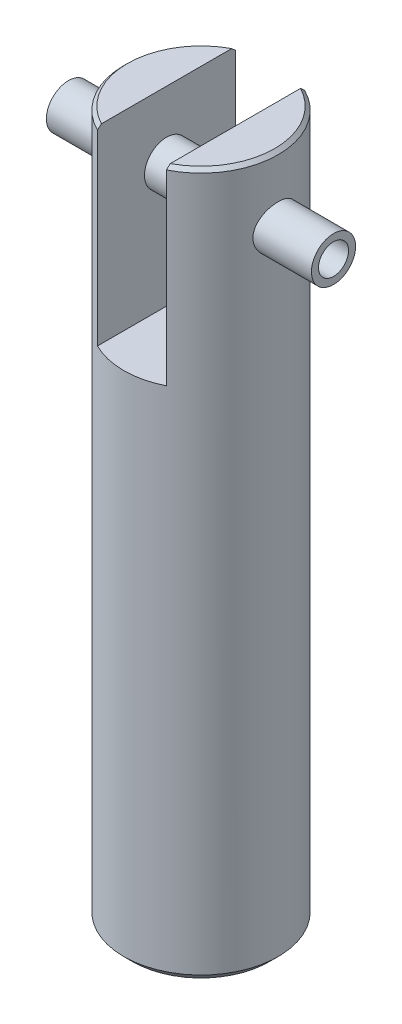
ISO-10303-21;
HEADER;
FILE_DESCRIPTION(('STEP AP214'),'2;1');
FILE_NAME('part.step','',(''),(''),'','','');
FILE_SCHEMA(('AUTOMOTIVE_DESIGN { 1 0 10303 214 1 1 1 1 }'));
ENDSEC;
DATA;
#1=APPLICATION_CONTEXT('core data for automotive mechanical design processes');
#2=APPLICATION_PROTOCOL_DEFINITION('international standard','automotive_design',2000,#1);
#3=PRODUCT_CONTEXT('',#1,'mechanical');
#4=PRODUCT('Part','Part','',(#3));
#5=PRODUCT_RELATED_PRODUCT_CATEGORY('part','',(#4));
#6=PRODUCT_DEFINITION_FORMATION('','',#4);
#7=PRODUCT_DEFINITION_CONTEXT('part definition',#1,'design');
#8=PRODUCT_DEFINITION('design','',#6,#7);
#9=PRODUCT_DEFINITION_SHAPE('','',#8);
#10=(LENGTH_UNIT() NAMED_UNIT(*) SI_UNIT(.MILLI.,.METRE.));
#11=(NAMED_UNIT(*) PLANE_ANGLE_UNIT() SI_UNIT($,.RADIAN.));
#12=(NAMED_UNIT(*) SI_UNIT($,.STERADIAN.) SOLID_ANGLE_UNIT());
#13=UNCERTAINTY_MEASURE_WITH_UNIT(LENGTH_MEASURE(1.E-05),#10,'distance_accuracy_value','');
#14=(GEOMETRIC_REPRESENTATION_CONTEXT(3) GLOBAL_UNCERTAINTY_ASSIGNED_CONTEXT((#13)) GLOBAL_UNIT_ASSIGNED_CONTEXT((#10,
#11,#12)) REPRESENTATION_CONTEXT('',''));
#15=CARTESIAN_POINT('',(0.,0.,0.));
#16=DIRECTION('',(0.,0.,1.));
#17=DIRECTION('',(1.,0.,0.));
#18=AXIS2_PLACEMENT_3D('',#15,#16,#17);
#19=CARTESIAN_POINT('',(0.,50.8,0.));
#20=DIRECTION('',(0.,1.,0.));
#21=DIRECTION('',(0.,0.,1.));
#22=AXIS2_PLACEMENT_3D('',#19,#20,#21);
#23=PLANE('',#22);
#24=DIRECTION('',(0.,0.,-1.));
#25=VECTOR('',#24,1.);
#26=CARTESIAN_POINT('',(2.4765,50.8,0.));
#27=LINE('',#26,#25);
#28=CARTESIAN_POINT('',(2.4765,50.8,4.68118623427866));
#29=VERTEX_POINT('',#28);
#30=CARTESIAN_POINT('',(2.4765,50.8,-4.68118623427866));
#31=VERTEX_POINT('',#30);
#32=EDGE_CURVE('E130',#29,#31,#27,.T.);
#33=ORIENTED_EDGE('',*,*,#32,.F.);
#34=CARTESIAN_POINT('',(0.,50.8,0.));
#35=DIRECTION('',(0.,1.,0.));
#36=DIRECTION('',(0.,0.,1.));
#37=AXIS2_PLACEMENT_3D('',#34,#35,#36);
#38=CIRCLE('',#37,5.2959);
#39=EDGE_CURVE('E173',#29,#31,#38,.T.);
#40=ORIENTED_EDGE('',*,*,#39,.T.);
#41=EDGE_LOOP('',(#33,#40));
#42=FACE_BOUND('',#41,.T.);
#43=ADVANCED_FACE('F33',(#42),#23,.T.);
#44=CARTESIAN_POINT('',(0.,50.8,0.));
#45=DIRECTION('',(0.,-1.,0.));
#46=DIRECTION('',(0.,0.,-1.));
#47=AXIS2_PLACEMENT_3D('',#44,#45,#46);
#48=CYLINDRICAL_SURFACE('',#47,5.5499);
#49=CARTESIAN_POINT('',(0.,0.634999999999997,0.));
#50=DIRECTION('',(0.,1.,0.));
#51=DIRECTION('',(0.,0.,1.));
#52=AXIS2_PLACEMENT_3D('',#49,#50,#51);
#53=CIRCLE('',#52,5.5499);
#54=CARTESIAN_POINT('',(0.,0.634999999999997,5.5499));
#55=VERTEX_POINT('',#54);
#56=EDGE_CURVE('E114',#55,#55,#53,.T.);
#57=ORIENTED_EDGE('',*,*,#56,.T.);
#58=EDGE_LOOP('',(#57));
#59=FACE_BOUND('',#58,.T.);
#60=CARTESIAN_POINT('',(-5.31801031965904,46.0375,1.5875));
#61=CARTESIAN_POINT('',(-5.31801153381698,46.124690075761,1.58749843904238));
#62=CARTESIAN_POINT('',(-5.32017803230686,46.2118959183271,1.58029244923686));
#63=CARTESIAN_POINT('',(-5.32857915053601,46.383771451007,1.55172455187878));
#64=CARTESIAN_POINT('',(-5.33481541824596,46.4684400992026,1.53035690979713));
#65=CARTESIAN_POINT('',(-5.35059325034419,46.6327291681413,1.47423984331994));
#66=CARTESIAN_POINT('',(-5.36012968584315,46.712357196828,1.43951117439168));
#67=CARTESIAN_POINT('',(-5.38142657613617,46.8646733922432,1.357724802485));
#68=CARTESIAN_POINT('',(-5.39318729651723,46.9373607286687,1.31066562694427));
#69=CARTESIAN_POINT('',(-5.41798697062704,47.0758233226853,1.20410525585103));
#70=CARTESIAN_POINT('',(-5.43105123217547,47.141369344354,1.14431201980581));
#71=CARTESIAN_POINT('',(-5.45676883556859,47.2616535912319,1.01460766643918));
#72=CARTESIAN_POINT('',(-5.4694221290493,47.31639054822,0.944695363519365));
#73=CARTESIAN_POINT('',(-5.49317740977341,47.414481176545,0.795124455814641));
#74=CARTESIAN_POINT('',(-5.50424608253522,47.457603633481,0.715308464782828));
#75=CARTESIAN_POINT('',(-5.52329253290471,47.5297275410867,0.549188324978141));
#76=CARTESIAN_POINT('',(-5.53127091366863,47.5587317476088,0.462885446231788));
#77=CARTESIAN_POINT('',(-5.5430588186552,47.6010444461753,0.28863733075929));
#78=CARTESIAN_POINT('',(-5.54697193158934,47.6147436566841,0.200794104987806));
#79=CARTESIAN_POINT('',(-5.55055207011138,47.6272902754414,0.0239748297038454));
#80=CARTESIAN_POINT('',(-5.55021990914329,47.6261405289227,-0.0650009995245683));
#81=CARTESIAN_POINT('',(-5.54542130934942,47.6092897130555,-0.238828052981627));
#82=CARTESIAN_POINT('',(-5.54107496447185,47.5940113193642,-0.32372408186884));
#83=CARTESIAN_POINT('',(-5.528880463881,47.5500240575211,-0.489692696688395));
#84=CARTESIAN_POINT('',(-5.52103209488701,47.52131437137,-0.570765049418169));
#85=CARTESIAN_POINT('',(-5.5025441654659,47.4509772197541,-0.727821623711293));
#86=CARTESIAN_POINT('',(-5.49187498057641,47.4092117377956,-0.803740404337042));
#87=CARTESIAN_POINT('',(-5.46888495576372,47.3140562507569,-0.947630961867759));
#88=CARTESIAN_POINT('',(-5.45656375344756,47.2606636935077,-1.01560098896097));
#89=CARTESIAN_POINT('',(-5.43108415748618,47.1415547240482,-1.14418800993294));
#90=CARTESIAN_POINT('',(-5.41791156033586,47.0754709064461,-1.20446229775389));
#91=CARTESIAN_POINT('',(-5.39259795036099,46.9340008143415,-1.31316439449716));
#92=CARTESIAN_POINT('',(-5.38045702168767,46.8586137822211,-1.36159123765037));
#93=CARTESIAN_POINT('',(-5.35851793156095,46.6998444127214,-1.44553848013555));
#94=CARTESIAN_POINT('',(-5.34873933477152,46.6164028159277,-1.48095228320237));
#95=CARTESIAN_POINT('',(-5.33286814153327,46.4443979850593,-1.53713018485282));
#96=CARTESIAN_POINT('',(-5.3267744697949,46.3558362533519,-1.55789855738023));
#97=CARTESIAN_POINT('',(-5.31919614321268,46.1793426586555,-1.58357719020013));
#98=CARTESIAN_POINT('',(-5.31756136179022,46.0914923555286,-1.58900421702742));
#99=CARTESIAN_POINT('',(-5.3186726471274,45.916136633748,-1.58528092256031));
#100=CARTESIAN_POINT('',(-5.32141816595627,45.8286311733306,-1.57613242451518));
#101=CARTESIAN_POINT('',(-5.33083433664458,45.6585323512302,-1.54397609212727));
#102=CARTESIAN_POINT('',(-5.33741340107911,45.5758723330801,-1.52129135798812));
#103=CARTESIAN_POINT('',(-5.35366280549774,45.4155339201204,-1.46307617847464));
#104=CARTESIAN_POINT('',(-5.36333359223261,45.3378562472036,-1.42754387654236));
#105=CARTESIAN_POINT('',(-5.38497521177,45.1875596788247,-1.34363252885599));
#106=CARTESIAN_POINT('',(-5.39699712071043,45.1151139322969,-1.29495684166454));
#107=CARTESIAN_POINT('',(-5.4218722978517,44.979229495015,-1.18649929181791));
#108=CARTESIAN_POINT('',(-5.43472574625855,44.9157927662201,-1.12671501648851));
#109=CARTESIAN_POINT('',(-5.46034251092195,44.7975168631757,-0.995324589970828));
#110=CARTESIAN_POINT('',(-5.47308803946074,44.743041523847,-0.923386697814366));
#111=CARTESIAN_POINT('',(-5.49661105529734,44.6469327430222,-0.771093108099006));
#112=CARTESIAN_POINT('',(-5.50738864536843,44.60529863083,-0.690737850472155));
#113=CARTESIAN_POINT('',(-5.52569290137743,44.5364517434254,-0.52444614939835));
#114=CARTESIAN_POINT('',(-5.53324408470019,44.5091298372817,-0.438557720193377));
#115=CARTESIAN_POINT('',(-5.54435299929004,44.4693847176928,-0.26315653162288));
#116=CARTESIAN_POINT('',(-5.54791176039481,44.4569576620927,-0.173644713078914));
#117=CARTESIAN_POINT('',(-5.55057818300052,44.4476253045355,0.00308479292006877));
#118=CARTESIAN_POINT('',(-5.54983786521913,44.4501899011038,0.0902725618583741));
#119=CARTESIAN_POINT('',(-5.54434135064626,44.4695165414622,0.262923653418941));
#120=CARTESIAN_POINT('',(-5.5395853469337,44.4862779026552,0.348387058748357));
#121=CARTESIAN_POINT('',(-5.52662972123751,44.5332056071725,0.514424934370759));
#122=CARTESIAN_POINT('',(-5.51846140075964,44.5632502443,0.595036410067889));
#123=CARTESIAN_POINT('',(-5.49952923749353,44.6357833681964,0.750118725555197));
#124=CARTESIAN_POINT('',(-5.48876499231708,44.6782737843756,0.824588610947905));
#125=CARTESIAN_POINT('',(-5.46538170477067,44.7759636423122,0.967682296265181));
#126=CARTESIAN_POINT('',(-5.4527169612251,44.8315039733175,1.03606585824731));
#127=CARTESIAN_POINT('',(-5.42712211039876,44.9530892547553,1.16272058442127));
#128=CARTESIAN_POINT('',(-5.41419193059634,45.0191371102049,1.22098894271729));
#129=CARTESIAN_POINT('',(-5.38913280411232,45.1619533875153,1.32729226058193));
#130=CARTESIAN_POINT('',(-5.37703394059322,45.2389584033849,1.37501717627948));
#131=CARTESIAN_POINT('',(-5.35546231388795,45.4002349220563,1.45678158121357));
#132=CARTESIAN_POINT('',(-5.34598808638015,45.4845023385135,1.49082870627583));
#133=CARTESIAN_POINT('',(-5.33184181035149,45.6464401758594,1.54059382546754));
#134=CARTESIAN_POINT('',(-5.32670086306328,45.7235125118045,1.55813839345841));
#135=CARTESIAN_POINT('',(-5.31978483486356,45.8795524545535,1.58159126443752));
#136=CARTESIAN_POINT('',(-5.31800921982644,45.9585197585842,1.58750141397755));
#137=CARTESIAN_POINT('',(-5.31801031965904,46.0375,1.5875));
#138=B_SPLINE_CURVE_WITH_KNOTS('',3,(#60,#61,#62,#63,#64,#65,#66,#67,#68,#69,#70,#71,#72,#73,
#74,#75,#76,#77,#78,#79,#80,#81,#82,#83,#84,#85,#86,#87,#88,#89,#90,#91,#92,#93,#94,#95,#96,#97,
#98,#99,#100,#101,#102,#103,#104,#105,#106,#107,#108,#109,#110,#111,#112,#113,#114,#115,#116,
#117,#118,#119,#120,#121,#122,#123,#124,#125,#126,#127,#128,#129,#130,#131,#132,#133,#134,#135,
#136,#137),.UNSPECIFIED.,.T.,.F.,(4,2,2,2,2,2,2,2,2,2,2,2,2,2,2,2,2,2,2,2,2,2,2,2,2,2,2,2,2,2,2,
2,2,2,2,2,2,2,4),(0.,0.261279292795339,0.522664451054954,0.783645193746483,1.04465711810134,
1.31246475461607,1.58030379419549,1.85313558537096,2.12591409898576,2.39155735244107,
2.65714970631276,2.91504496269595,3.17295592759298,3.43369121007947,3.69448378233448,
3.96444898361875,4.23443618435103,4.50658812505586,4.77866061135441,5.0414525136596,
5.30421154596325,5.56093639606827,5.81769835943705,6.08082560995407,6.34401007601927,
6.61610579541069,6.88818730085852,7.15816281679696,7.42806867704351,7.68848982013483,
7.94889844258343,8.20696901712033,8.46507962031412,8.73087921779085,8.99675242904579,
9.26963013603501,9.54235529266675,9.77907004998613,10.0157472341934),.UNSPECIFIED.);
#139=CARTESIAN_POINT('',(-5.31801031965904,46.0375,1.5875));
#140=VERTEX_POINT('',#139);
#141=EDGE_CURVE('E217',#140,#140,#138,.T.);
#142=ORIENTED_EDGE('',*,*,#141,.F.);
#143=EDGE_LOOP('',(#142));
#144=FACE_BOUND('',#143,.T.);
#145=CARTESIAN_POINT('',(5.31801031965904,46.0375,1.5875));
#146=CARTESIAN_POINT('',(5.31801153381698,45.950309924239,1.58749843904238));
#147=CARTESIAN_POINT('',(5.32017803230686,45.8631040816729,1.58029244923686));
#148=CARTESIAN_POINT('',(5.32857915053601,45.691228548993,1.55172455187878));
#149=CARTESIAN_POINT('',(5.33481541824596,45.6065599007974,1.53035690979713));
#150=CARTESIAN_POINT('',(5.35059325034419,45.4422708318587,1.47423984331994));
#151=CARTESIAN_POINT('',(5.36012968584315,45.362642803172,1.43951117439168));
#152=CARTESIAN_POINT('',(5.38142657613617,45.2103266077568,1.357724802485));
#153=CARTESIAN_POINT('',(5.39318729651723,45.1376392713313,1.31066562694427));
#154=CARTESIAN_POINT('',(5.41798697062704,44.9991766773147,1.20410525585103));
#155=CARTESIAN_POINT('',(5.43105123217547,44.933630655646,1.14431201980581));
#156=CARTESIAN_POINT('',(5.45676883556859,44.8133464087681,1.01460766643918));
#157=CARTESIAN_POINT('',(5.4694221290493,44.75860945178,0.944695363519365));
#158=CARTESIAN_POINT('',(5.49317740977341,44.6605188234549,0.79512445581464));
#159=CARTESIAN_POINT('',(5.50424608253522,44.617396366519,0.715308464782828));
#160=CARTESIAN_POINT('',(5.52329253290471,44.5452724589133,0.549188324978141));
#161=CARTESIAN_POINT('',(5.53127091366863,44.5162682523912,0.462885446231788));
#162=CARTESIAN_POINT('',(5.5430588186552,44.4739555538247,0.28863733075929));
#163=CARTESIAN_POINT('',(5.54697193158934,44.4602563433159,0.200794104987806));
#164=CARTESIAN_POINT('',(5.55055207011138,44.4477097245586,0.0239748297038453));
#165=CARTESIAN_POINT('',(5.55021990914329,44.4488594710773,-0.0650009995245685));
#166=CARTESIAN_POINT('',(5.54542130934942,44.4657102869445,-0.238828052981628));
#167=CARTESIAN_POINT('',(5.54107496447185,44.4809886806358,-0.323724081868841));
#168=CARTESIAN_POINT('',(5.528880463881,44.5249759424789,-0.489692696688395));
#169=CARTESIAN_POINT('',(5.52103209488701,44.55368562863,-0.570765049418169));
#170=CARTESIAN_POINT('',(5.5025441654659,44.6240227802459,-0.727821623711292));
#171=CARTESIAN_POINT('',(5.49187498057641,44.6657882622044,-0.803740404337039));
#172=CARTESIAN_POINT('',(5.46888495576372,44.7609437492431,-0.947630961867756));
#173=CARTESIAN_POINT('',(5.45656375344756,44.8143363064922,-1.01560098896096));
#174=CARTESIAN_POINT('',(5.43108415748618,44.9334452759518,-1.14418800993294));
#175=CARTESIAN_POINT('',(5.41791156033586,44.9995290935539,-1.20446229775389));
#176=CARTESIAN_POINT('',(5.39259795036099,45.1409991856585,-1.31316439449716));
#177=CARTESIAN_POINT('',(5.38045702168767,45.2163862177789,-1.36159123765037));
#178=CARTESIAN_POINT('',(5.35851793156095,45.3751555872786,-1.44553848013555));
#179=CARTESIAN_POINT('',(5.34873933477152,45.4585971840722,-1.48095228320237));
#180=CARTESIAN_POINT('',(5.33286814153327,45.6306020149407,-1.53713018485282));
#181=CARTESIAN_POINT('',(5.3267744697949,45.719163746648,-1.55789855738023));
#182=CARTESIAN_POINT('',(5.31919614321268,45.8956573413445,-1.58357719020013));
#183=CARTESIAN_POINT('',(5.31756136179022,45.9835076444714,-1.58900421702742));
#184=CARTESIAN_POINT('',(5.3186726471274,46.158863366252,-1.58528092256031));
#185=CARTESIAN_POINT('',(5.32141816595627,46.2463688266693,-1.57613242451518));
#186=CARTESIAN_POINT('',(5.33083433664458,46.4164676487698,-1.54397609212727));
#187=CARTESIAN_POINT('',(5.33741340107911,46.4991276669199,-1.52129135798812));
#188=CARTESIAN_POINT('',(5.35366280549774,46.6594660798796,-1.46307617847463));
#189=CARTESIAN_POINT('',(5.36333359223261,46.7371437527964,-1.42754387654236));
#190=CARTESIAN_POINT('',(5.38497521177,46.8874403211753,-1.34363252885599));
#191=CARTESIAN_POINT('',(5.39699712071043,46.9598860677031,-1.29495684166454));
#192=CARTESIAN_POINT('',(5.4218722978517,47.095770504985,-1.18649929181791));
#193=CARTESIAN_POINT('',(5.43472574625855,47.1592072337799,-1.12671501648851));
#194=CARTESIAN_POINT('',(5.46034251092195,47.2774831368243,-0.995324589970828));
#195=CARTESIAN_POINT('',(5.47308803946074,47.331958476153,-0.923386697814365));
#196=CARTESIAN_POINT('',(5.49661105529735,47.4280672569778,-0.771093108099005));
#197=CARTESIAN_POINT('',(5.50738864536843,47.46970136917,-0.690737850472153));
#198=CARTESIAN_POINT('',(5.52569290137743,47.5385482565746,-0.524446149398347));
#199=CARTESIAN_POINT('',(5.53324408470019,47.5658701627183,-0.438557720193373));
#200=CARTESIAN_POINT('',(5.54435299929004,47.6056152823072,-0.263156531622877));
#201=CARTESIAN_POINT('',(5.54791176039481,47.6180423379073,-0.173644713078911));
#202=CARTESIAN_POINT('',(5.55057818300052,47.6273746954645,0.00308479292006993));
#203=CARTESIAN_POINT('',(5.54983786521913,47.6248100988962,0.0902725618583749));
#204=CARTESIAN_POINT('',(5.54434135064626,47.6054834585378,0.262923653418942));
#205=CARTESIAN_POINT('',(5.5395853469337,47.5887220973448,0.348387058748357));
#206=CARTESIAN_POINT('',(5.52662972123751,47.5417943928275,0.514424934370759));
#207=CARTESIAN_POINT('',(5.51846140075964,47.5117497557,0.595036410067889));
#208=CARTESIAN_POINT('',(5.49952923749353,47.4392166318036,0.750118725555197));
#209=CARTESIAN_POINT('',(5.48876499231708,47.3967262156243,0.824588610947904));
#210=CARTESIAN_POINT('',(5.46538170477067,47.2990363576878,0.967682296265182));
#211=CARTESIAN_POINT('',(5.4527169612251,47.2434960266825,1.03606585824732));
#212=CARTESIAN_POINT('',(5.42712211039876,47.1219107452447,1.16272058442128));
#213=CARTESIAN_POINT('',(5.41419193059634,47.0558628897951,1.22098894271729));
#214=CARTESIAN_POINT('',(5.38913280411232,46.9130466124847,1.32729226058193));
#215=CARTESIAN_POINT('',(5.37703394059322,46.8360415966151,1.37501717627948));
#216=CARTESIAN_POINT('',(5.35546231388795,46.6747650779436,1.45678158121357));
#217=CARTESIAN_POINT('',(5.34598808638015,46.5904976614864,1.49082870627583));
#218=CARTESIAN_POINT('',(5.33184181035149,46.4285598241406,1.54059382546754));
#219=CARTESIAN_POINT('',(5.32670086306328,46.3514874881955,1.55813839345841));
#220=CARTESIAN_POINT('',(5.31978483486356,46.1954475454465,1.58159126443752));
#221=CARTESIAN_POINT('',(5.31800921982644,46.1164802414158,1.58750141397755));
#222=CARTESIAN_POINT('',(5.31801031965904,46.0375,1.5875));
#223=B_SPLINE_CURVE_WITH_KNOTS('',3,(#145,#146,#147,#148,#149,#150,#151,#152,#153,#154,#155,
#156,#157,#158,#159,#160,#161,#162,#163,#164,#165,#166,#167,#168,#169,#170,#171,#172,#173,#174,
#175,#176,#177,#178,#179,#180,#181,#182,#183,#184,#185,#186,#187,#188,#189,#190,#191,#192,#193,
#194,#195,#196,#197,#198,#199,#200,#201,#202,#203,#204,#205,#206,#207,#208,#209,#210,#211,#212,
#213,#214,#215,#216,#217,#218,#219,#220,#221,#222),.UNSPECIFIED.,.T.,.F.,(4,2,2,2,2,2,2,2,2,2,2,
2,2,2,2,2,2,2,2,2,2,2,2,2,2,2,2,2,2,2,2,2,2,2,2,2,2,2,4),(0.,0.261279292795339,
0.522664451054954,0.783645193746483,1.04465711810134,1.31246475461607,1.58030379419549,
1.85313558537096,2.12591409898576,2.39155735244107,2.65714970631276,2.91504496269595,
3.17295592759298,3.43369121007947,3.69448378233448,3.96444898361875,4.23443618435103,
4.50658812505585,4.77866061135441,5.0414525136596,5.30421154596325,5.56093639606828,
5.81769835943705,6.08082560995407,6.34401007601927,6.61610579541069,6.88818730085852,
7.15816281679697,7.42806867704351,7.68848982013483,7.94889844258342,8.20696901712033,
8.46507962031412,8.73087921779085,8.99675242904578,9.26963013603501,9.54235529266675,
9.77907004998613,10.0157472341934),.UNSPECIFIED.);
#224=CARTESIAN_POINT('',(5.31801031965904,46.0375,1.5875));
#225=VERTEX_POINT('',#224);
#226=EDGE_CURVE('E121',#225,#225,#223,.T.);
#227=ORIENTED_EDGE('',*,*,#226,.F.);
#228=EDGE_LOOP('',(#227));
#229=FACE_BOUND('',#228,.T.);
#230=DIRECTION('',(0.,-1.,0.));
#231=VECTOR('',#230,1.);
#232=CARTESIAN_POINT('',(-2.4765,50.8,4.96672304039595));
#233=LINE('',#232,#231);
#234=CARTESIAN_POINT('',(-2.4765,37.1094,4.96672304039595));
#235=VERTEX_POINT('',#234);
#236=CARTESIAN_POINT('',(-2.4765,50.546,4.96672304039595));
#237=VERTEX_POINT('',#236);
#238=EDGE_CURVE('E103',#235,#237,#233,.F.);
#239=ORIENTED_EDGE('',*,*,#238,.T.);
#240=CARTESIAN_POINT('',(0.,50.546,0.));
#241=DIRECTION('',(0.,1.,0.));
#242=DIRECTION('',(0.,0.,1.));
#243=AXIS2_PLACEMENT_3D('',#240,#241,#242);
#244=CIRCLE('',#243,5.5499);
#245=CARTESIAN_POINT('',(-2.4765,50.546,-4.96672304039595));
#246=VERTEX_POINT('',#245);
#247=EDGE_CURVE('E98',#237,#246,#244,.F.);
#248=ORIENTED_EDGE('',*,*,#247,.T.);
#249=DIRECTION('',(0.,-1.,0.));
#250=VECTOR('',#249,1.);
#251=CARTESIAN_POINT('',(-2.4765,50.8,-4.96672304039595));
#252=LINE('',#251,#250);
#253=CARTESIAN_POINT('',(-2.4765,37.1094,-4.96672304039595));
#254=VERTEX_POINT('',#253);
#255=EDGE_CURVE('E91',#246,#254,#252,.T.);
#256=ORIENTED_EDGE('',*,*,#255,.T.);
#257=CARTESIAN_POINT('',(0.,37.1094,0.));
#258=DIRECTION('',(0.,1.,0.));
#259=DIRECTION('',(0.,0.,1.));
#260=AXIS2_PLACEMENT_3D('',#257,#258,#259);
#261=CIRCLE('',#260,5.5499);
#262=CARTESIAN_POINT('',(2.4765,37.1094,-4.96672304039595));
#263=VERTEX_POINT('',#262);
#264=EDGE_CURVE('E96',#263,#254,#261,.T.);
#265=ORIENTED_EDGE('',*,*,#264,.F.);
#266=DIRECTION('',(0.,-1.,0.));
#267=VECTOR('',#266,1.);
#268=CARTESIAN_POINT('',(2.4765,50.8,-4.96672304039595));
#269=LINE('',#268,#267);
#270=CARTESIAN_POINT('',(2.4765,50.546,-4.96672304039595));
#271=VERTEX_POINT('',#270);
#272=EDGE_CURVE('E102',#263,#271,#269,.F.);
#273=ORIENTED_EDGE('',*,*,#272,.T.);
#274=CARTESIAN_POINT('',(0.,50.546,0.));
#275=DIRECTION('',(0.,1.,0.));
#276=DIRECTION('',(0.,0.,1.));
#277=AXIS2_PLACEMENT_3D('',#274,#275,#276);
#278=CIRCLE('',#277,5.5499);
#279=CARTESIAN_POINT('',(2.4765,50.546,4.96672304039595));
#280=VERTEX_POINT('',#279);
#281=EDGE_CURVE('E175',#271,#280,#278,.F.);
#282=ORIENTED_EDGE('',*,*,#281,.T.);
#283=DIRECTION('',(0.,-1.,0.));
#284=VECTOR('',#283,1.);
#285=CARTESIAN_POINT('',(2.4765,50.8,4.96672304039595));
#286=LINE('',#285,#284);
#287=CARTESIAN_POINT('',(2.4765,37.1094,4.96672304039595));
#288=VERTEX_POINT('',#287);
#289=EDGE_CURVE('E126',#280,#288,#286,.T.);
#290=ORIENTED_EDGE('',*,*,#289,.T.);
#291=EDGE_CURVE('E115',#235,#288,#261,.T.);
#292=ORIENTED_EDGE('',*,*,#291,.F.);
#293=EDGE_LOOP('',(#239,#248,#256,#265,#273,#282,#290,#292));
#294=FACE_BOUND('',#293,.T.);
#295=ADVANCED_FACE('F94',(#59,#144,#229,#294),#48,.T.);
#296=DIRECTION('',(0.,0.,1.));
#297=VECTOR('',#296,1.);
#298=CARTESIAN_POINT('',(-2.4765,50.8,0.));
#299=LINE('',#298,#297);
#300=CARTESIAN_POINT('',(-2.4765,50.8,-4.68118623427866));
#301=VERTEX_POINT('',#300);
#302=CARTESIAN_POINT('',(-2.4765,50.8,4.68118623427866));
#303=VERTEX_POINT('',#302);
#304=EDGE_CURVE('E128',#301,#303,#299,.T.);
#305=ORIENTED_EDGE('',*,*,#304,.F.);
#306=CARTESIAN_POINT('',(0.,50.8,0.));
#307=DIRECTION('',(0.,1.,0.));
#308=DIRECTION('',(0.,0.,1.));
#309=AXIS2_PLACEMENT_3D('',#306,#307,#308);
#310=CIRCLE('',#309,5.2959);
#311=EDGE_CURVE('E137',#301,#303,#310,.T.);
#312=ORIENTED_EDGE('',*,*,#311,.T.);
#313=EDGE_LOOP('',(#305,#312));
#314=FACE_BOUND('',#313,.T.);
#315=ADVANCED_FACE('F166',(#314),#23,.T.);
#316=CARTESIAN_POINT('',(0.,0.,0.));
#317=DIRECTION('',(0.,1.,0.));
#318=DIRECTION('',(0.,0.,1.));
#319=AXIS2_PLACEMENT_3D('',#316,#317,#318);
#320=PLANE('',#319);
#321=CARTESIAN_POINT('',(0.,0.,0.));
#322=DIRECTION('',(0.,1.,0.));
#323=DIRECTION('',(0.,0.,1.));
#324=AXIS2_PLACEMENT_3D('',#321,#322,#323);
#325=CIRCLE('',#324,4.9149);
#326=CARTESIAN_POINT('',(0.,0.,4.9149));
#327=VERTEX_POINT('',#326);
#328=EDGE_CURVE('E134',#327,#327,#325,.F.);
#329=ORIENTED_EDGE('',*,*,#328,.T.);
#330=EDGE_LOOP('',(#329));
#331=FACE_BOUND('',#330,.T.);
#332=ADVANCED_FACE('F181',(#331),#320,.F.);
#333=CARTESIAN_POINT('',(0.,37.1094,0.));
#334=DIRECTION('',(0.,1.,0.));
#335=DIRECTION('',(0.,0.,1.));
#336=AXIS2_PLACEMENT_3D('',#333,#334,#335);
#337=PLANE('',#336);
#338=ORIENTED_EDGE('',*,*,#264,.T.);
#339=DIRECTION('',(0.,0.,1.));
#340=VECTOR('',#339,1.);
#341=CARTESIAN_POINT('',(-2.4765,37.1094,-9.525));
#342=LINE('',#341,#340);
#343=EDGE_CURVE('E110',#254,#235,#342,.T.);
#344=ORIENTED_EDGE('',*,*,#343,.T.);
#345=ORIENTED_EDGE('',*,*,#291,.T.);
#346=DIRECTION('',(0.,0.,-1.));
#347=VECTOR('',#346,1.);
#348=CARTESIAN_POINT('',(2.4765,37.1094,-9.525));
#349=LINE('',#348,#347);
#350=EDGE_CURVE('E113',#288,#263,#349,.T.);
#351=ORIENTED_EDGE('',*,*,#350,.T.);
#352=EDGE_LOOP('',(#338,#344,#345,#351));
#353=FACE_BOUND('',#352,.T.);
#354=ADVANCED_FACE('F108',(#353),#337,.T.);
#355=CARTESIAN_POINT('',(2.4765,37.1094,-9.525));
#356=DIRECTION('',(1.,0.,0.));
#357=DIRECTION('',(0.,0.,-1.));
#358=AXIS2_PLACEMENT_3D('',#355,#356,#357);
#359=PLANE('',#358);
#360=CARTESIAN_POINT('',(2.4765,46.0375,0.));
#361=DIRECTION('',(1.,0.,0.));
#362=DIRECTION('',(0.,0.,-1.));
#363=AXIS2_PLACEMENT_3D('',#360,#361,#362);
#364=CIRCLE('',#363,1.5875);
#365=CARTESIAN_POINT('',(2.4765,46.0375,1.5875));
#366=VERTEX_POINT('',#365);
#367=EDGE_CURVE('E222',#366,#366,#364,.F.);
#368=ORIENTED_EDGE('',*,*,#367,.F.);
#369=EDGE_LOOP('',(#368));
#370=FACE_BOUND('',#369,.T.);
#371=ORIENTED_EDGE('',*,*,#32,.T.);
#372=CARTESIAN_POINT('',(2.4765,50.8,-4.68118623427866));
#373=CARTESIAN_POINT('',(2.4765,50.757812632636,-4.72890555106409));
#374=CARTESIAN_POINT('',(2.4765,50.7155522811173,-4.77655994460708));
#375=CARTESIAN_POINT('',(2.4765,50.6308856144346,-4.87173887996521));
#376=CARTESIAN_POINT('',(2.4765,50.5884792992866,-4.91926342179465));
#377=CARTESIAN_POINT('',(2.4765,50.546,-4.96672304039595));
#378=B_SPLINE_CURVE_WITH_KNOTS('',3,(#372,#373,#374,#375,#376,#377),.UNSPECIFIED.,.F.,.F.,(4,2,
4),(0.,0.191080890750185,0.382161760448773),.UNSPECIFIED.);
#379=EDGE_CURVE('E11',#31,#271,#378,.T.);
#380=ORIENTED_EDGE('',*,*,#379,.T.);
#381=ORIENTED_EDGE('',*,*,#272,.F.);
#382=ORIENTED_EDGE('',*,*,#350,.F.);
#383=ORIENTED_EDGE('',*,*,#289,.F.);
#384=CARTESIAN_POINT('',(2.4765,50.546,4.96672304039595));
#385=CARTESIAN_POINT('',(2.4765,50.5884792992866,4.91926342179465));
#386=CARTESIAN_POINT('',(2.4765,50.6308856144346,4.87173887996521));
#387=CARTESIAN_POINT('',(2.4765,50.7155522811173,4.77655994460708));
#388=CARTESIAN_POINT('',(2.4765,50.757812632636,4.72890555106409));
#389=CARTESIAN_POINT('',(2.4765,50.8,4.68118623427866));
#390=B_SPLINE_CURVE_WITH_KNOTS('',3,(#384,#385,#386,#387,#388,#389),.UNSPECIFIED.,.F.,.F.,(4,2,
4),(0.,0.191080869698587,0.382161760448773),.UNSPECIFIED.);
#391=EDGE_CURVE('E46',#280,#29,#390,.T.);
#392=ORIENTED_EDGE('',*,*,#391,.T.);
#393=EDGE_LOOP('',(#371,#380,#381,#382,#383,#392));
#394=FACE_BOUND('',#393,.T.);
#395=ADVANCED_FACE('F158',(#370,#394),#359,.F.);
#396=CARTESIAN_POINT('',(-2.4765,37.1094,-9.525));
#397=DIRECTION('',(-1.,0.,0.));
#398=DIRECTION('',(0.,0.,1.));
#399=AXIS2_PLACEMENT_3D('',#396,#397,#398);
#400=PLANE('',#399);
#401=CARTESIAN_POINT('',(-2.4765,46.0375,0.));
#402=DIRECTION('',(-1.,0.,0.));
#403=DIRECTION('',(0.,0.,1.));
#404=AXIS2_PLACEMENT_3D('',#401,#402,#403);
#405=CIRCLE('',#404,1.5875);
#406=CARTESIAN_POINT('',(-2.4765,46.0375,1.5875));
#407=VERTEX_POINT('',#406);
#408=EDGE_CURVE('E255',#407,#407,#405,.F.);
#409=ORIENTED_EDGE('',*,*,#408,.F.);
#410=EDGE_LOOP('',(#409));
#411=FACE_BOUND('',#410,.T.);
#412=ORIENTED_EDGE('',*,*,#304,.T.);
#413=CARTESIAN_POINT('',(-2.4765,50.8,4.68118623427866));
#414=CARTESIAN_POINT('',(-2.4765,50.757812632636,4.72890555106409));
#415=CARTESIAN_POINT('',(-2.4765,50.7155522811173,4.77655994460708));
#416=CARTESIAN_POINT('',(-2.4765,50.6308856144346,4.87173887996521));
#417=CARTESIAN_POINT('',(-2.4765,50.5884792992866,4.91926342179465));
#418=CARTESIAN_POINT('',(-2.4765,50.546,4.96672304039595));
#419=B_SPLINE_CURVE_WITH_KNOTS('',3,(#413,#414,#415,#416,#417,#418),.UNSPECIFIED.,.F.,.F.,(4,2,
4),(0.,0.191080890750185,0.382161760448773),.UNSPECIFIED.);
#420=EDGE_CURVE('E146',#303,#237,#419,.T.);
#421=ORIENTED_EDGE('',*,*,#420,.T.);
#422=ORIENTED_EDGE('',*,*,#238,.F.);
#423=ORIENTED_EDGE('',*,*,#343,.F.);
#424=ORIENTED_EDGE('',*,*,#255,.F.);
#425=CARTESIAN_POINT('',(-2.4765,50.546,-4.96672304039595));
#426=CARTESIAN_POINT('',(-2.4765,50.5884792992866,-4.91926342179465));
#427=CARTESIAN_POINT('',(-2.4765,50.6308856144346,-4.87173887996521));
#428=CARTESIAN_POINT('',(-2.4765,50.7155522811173,-4.77655994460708));
#429=CARTESIAN_POINT('',(-2.4765,50.757812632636,-4.72890555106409));
#430=CARTESIAN_POINT('',(-2.4765,50.8,-4.68118623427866));
#431=B_SPLINE_CURVE_WITH_KNOTS('',3,(#425,#426,#427,#428,#429,#430),.UNSPECIFIED.,.F.,.F.,(4,2,
4),(0.,0.191080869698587,0.382161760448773),.UNSPECIFIED.);
#432=EDGE_CURVE('E140',#246,#301,#431,.T.);
#433=ORIENTED_EDGE('',*,*,#432,.T.);
#434=EDGE_LOOP('',(#412,#421,#422,#423,#424,#433));
#435=FACE_BOUND('',#434,.T.);
#436=ADVANCED_FACE('F118',(#411,#435),#400,.F.);
#437=CARTESIAN_POINT('',(0.,0.634999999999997,0.));
#438=DIRECTION('',(0.,1.,0.));
#439=DIRECTION('',(0.,0.,1.));
#440=AXIS2_PLACEMENT_3D('',#437,#438,#439);
#441=CONICAL_SURFACE('',#440,5.5499,0.785398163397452);
#442=ORIENTED_EDGE('',*,*,#328,.F.);
#443=EDGE_LOOP('',(#442));
#444=FACE_BOUND('',#443,.T.);
#445=ORIENTED_EDGE('',*,*,#56,.F.);
#446=EDGE_LOOP('',(#445));
#447=FACE_BOUND('',#446,.T.);
#448=ADVANCED_FACE('F157',(#444,#447),#441,.T.);
#449=CARTESIAN_POINT('',(0.,50.8,0.));
#450=DIRECTION('',(0.,-1.,0.));
#451=DIRECTION('',(0.,0.,-1.));
#452=AXIS2_PLACEMENT_3D('',#449,#450,#451);
#453=CONICAL_SURFACE('',#452,5.2959,0.785398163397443);
#454=ORIENTED_EDGE('',*,*,#432,.F.);
#455=ORIENTED_EDGE('',*,*,#247,.F.);
#456=ORIENTED_EDGE('',*,*,#420,.F.);
#457=ORIENTED_EDGE('',*,*,#311,.F.);
#458=EDGE_LOOP('',(#454,#455,#456,#457));
#459=FACE_BOUND('',#458,.T.);
#460=ADVANCED_FACE('F151',(#459),#453,.T.);
#461=CARTESIAN_POINT('',(0.,50.8,0.));
#462=DIRECTION('',(0.,-1.,0.));
#463=DIRECTION('',(0.,0.,-1.));
#464=AXIS2_PLACEMENT_3D('',#461,#462,#463);
#465=CONICAL_SURFACE('',#464,5.2959,0.785398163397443);
#466=ORIENTED_EDGE('',*,*,#391,.F.);
#467=ORIENTED_EDGE('',*,*,#281,.F.);
#468=ORIENTED_EDGE('',*,*,#379,.F.);
#469=ORIENTED_EDGE('',*,*,#39,.F.);
#470=EDGE_LOOP('',(#466,#467,#468,#469));
#471=FACE_BOUND('',#470,.T.);
#472=ADVANCED_FACE('F35',(#471),#465,.T.);
#473=CARTESIAN_POINT('',(9.525,46.0375,0.));
#474=DIRECTION('',(-1.,0.,0.));
#475=DIRECTION('',(0.,0.,1.));
#476=AXIS2_PLACEMENT_3D('',#473,#474,#475);
#477=CYLINDRICAL_SURFACE('',#476,1.5875);
#478=CARTESIAN_POINT('',(-2.4765,46.0375,1.5875));
#479=CARTESIAN_POINT('',(-2.42490625,46.0375,1.5875));
#480=CARTESIAN_POINT('',(-2.3733125,46.0375,1.5875));
#481=CARTESIAN_POINT('',(-2.270125,46.0375,1.5875));
#482=CARTESIAN_POINT('',(-2.21853125,46.0375,1.5875));
#483=CARTESIAN_POINT('',(-2.11534375,46.0375,1.5875));
#484=CARTESIAN_POINT('',(-2.06375,46.0375,1.5875));
#485=CARTESIAN_POINT('',(-1.9605625,46.0375,1.5875));
#486=CARTESIAN_POINT('',(-1.90896875,46.0375,1.5875));
#487=CARTESIAN_POINT('',(-1.80578125,46.0375,1.5875));
#488=CARTESIAN_POINT('',(-1.7541875,46.0375,1.5875));
#489=CARTESIAN_POINT('',(-1.651,46.0375,1.5875));
#490=CARTESIAN_POINT('',(-1.59940625,46.0375,1.5875));
#491=CARTESIAN_POINT('',(-1.49621875,46.0375,1.5875));
#492=CARTESIAN_POINT('',(-1.444625,46.0375,1.5875));
#493=CARTESIAN_POINT('',(-1.3414375,46.0375,1.5875));
#494=CARTESIAN_POINT('',(-1.28984375,46.0375,1.5875));
#495=CARTESIAN_POINT('',(-1.18665625,46.0375,1.5875));
#496=CARTESIAN_POINT('',(-1.1350625,46.0375,1.5875));
#497=CARTESIAN_POINT('',(-1.031875,46.0375,1.5875));
#498=CARTESIAN_POINT('',(-0.980281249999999,46.0375,1.5875));
#499=CARTESIAN_POINT('',(-0.877093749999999,46.0375,1.5875));
#500=CARTESIAN_POINT('',(-0.825499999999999,46.0375,1.5875));
#501=CARTESIAN_POINT('',(-0.7223125,46.0375,1.5875));
#502=CARTESIAN_POINT('',(-0.67071875,46.0375,1.5875));
#503=CARTESIAN_POINT('',(-0.567531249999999,46.0375,1.5875));
#504=CARTESIAN_POINT('',(-0.515937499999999,46.0375,1.5875));
#505=CARTESIAN_POINT('',(-0.412749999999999,46.0375,1.5875));
#506=CARTESIAN_POINT('',(-0.361156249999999,46.0375,1.5875));
#507=CARTESIAN_POINT('',(-0.257968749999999,46.0375,1.5875));
#508=CARTESIAN_POINT('',(-0.206374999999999,46.0375,1.5875));
#509=CARTESIAN_POINT('',(-0.1031875,46.0375,1.5875));
#510=CARTESIAN_POINT('',(-0.0515937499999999,46.0375,1.5875));
#511=CARTESIAN_POINT('',(0.0515937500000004,46.0375,1.5875));
#512=CARTESIAN_POINT('',(0.103187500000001,46.0375,1.5875));
#513=CARTESIAN_POINT('',(0.206375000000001,46.0375,1.5875));
#514=CARTESIAN_POINT('',(0.257968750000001,46.0375,1.5875));
#515=CARTESIAN_POINT('',(0.361156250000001,46.0375,1.5875));
#516=CARTESIAN_POINT('',(0.41275,46.0375,1.5875));
#517=CARTESIAN_POINT('',(0.515937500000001,46.0375,1.5875));
#518=CARTESIAN_POINT('',(0.567531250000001,46.0375,1.5875));
#519=CARTESIAN_POINT('',(0.670718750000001,46.0375,1.5875));
#520=CARTESIAN_POINT('',(0.722312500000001,46.0375,1.5875));
#521=CARTESIAN_POINT('',(0.825500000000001,46.0375,1.5875));
#522=CARTESIAN_POINT('',(0.877093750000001,46.0375,1.5875));
#523=CARTESIAN_POINT('',(0.98028125,46.0375,1.5875));
#524=CARTESIAN_POINT('',(1.031875,46.0375,1.5875));
#525=CARTESIAN_POINT('',(1.1350625,46.0375,1.5875));
#526=CARTESIAN_POINT('',(1.18665625,46.0375,1.5875));
#527=CARTESIAN_POINT('',(1.28984375,46.0375,1.5875));
#528=CARTESIAN_POINT('',(1.3414375,46.0375,1.5875));
#529=CARTESIAN_POINT('',(1.444625,46.0375,1.5875));
#530=CARTESIAN_POINT('',(1.49621875,46.0375,1.5875));
#531=CARTESIAN_POINT('',(1.59940625,46.0375,1.5875));
#532=CARTESIAN_POINT('',(1.651,46.0375,1.5875));
#533=CARTESIAN_POINT('',(1.7541875,46.0375,1.5875));
#534=CARTESIAN_POINT('',(1.80578125,46.0375,1.5875));
#535=CARTESIAN_POINT('',(1.90896875,46.0375,1.5875));
#536=CARTESIAN_POINT('',(1.9605625,46.0375,1.5875));
#537=CARTESIAN_POINT('',(2.06375,46.0375,1.5875));
#538=CARTESIAN_POINT('',(2.11534375,46.0375,1.5875));
#539=CARTESIAN_POINT('',(2.21853125,46.0375,1.5875));
#540=CARTESIAN_POINT('',(2.270125,46.0375,1.5875));
#541=CARTESIAN_POINT('',(2.3733125,46.0375,1.5875));
#542=CARTESIAN_POINT('',(2.42490625,46.0375,1.5875));
#543=CARTESIAN_POINT('',(2.4765,46.0375,1.5875));
#544=B_SPLINE_CURVE_WITH_KNOTS('',3,(#478,#479,#480,#481,#482,#483,#484,#485,#486,#487,#488,
#489,#490,#491,#492,#493,#494,#495,#496,#497,#498,#499,#500,#501,#502,#503,#504,#505,#506,#507,
#508,#509,#510,#511,#512,#513,#514,#515,#516,#517,#518,#519,#520,#521,#522,#523,#524,#525,#526,
#527,#528,#529,#530,#531,#532,#533,#534,#535,#536,#537,#538,#539,#540,#541,#542,#543),
.UNSPECIFIED.,.F.,.F.,(4,2,2,2,2,2,2,2,2,2,2,2,2,2,2,2,2,2,2,2,2,2,2,2,2,2,2,2,2,2,2,2,4),(0.,
0.15478125,0.309562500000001,0.46434375,0.619125,0.773906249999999,0.928687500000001,1.08346875,
1.23825,1.39303125,1.5478125,1.70259375,1.857375,2.01215625,2.1669375,2.32171875,2.4765,
2.63128125,2.7860625,2.94084375,3.095625,3.25040625,3.4051875,3.55996875,3.71475,3.86953125,
4.0243125,4.17909375,4.333875,4.48865625,4.6434375,4.79821875,4.953),.UNSPECIFIED.);
#545=EDGE_CURVE('BSEAM195',#407,#366,#544,.T.);
#546=ORIENTED_EDGE('',*,*,#408,.T.);
#547=ORIENTED_EDGE('',*,*,#367,.T.);
#548=ORIENTED_EDGE('',*,*,#545,.T.);
#549=ORIENTED_EDGE('',*,*,#545,.F.);
#550=EDGE_LOOP('',(#546,#548,#547,#549));
#551=FACE_BOUND('',#550,.T.);
#552=ADVANCED_FACE('F195',(#551),#477,.T.);
#553=CARTESIAN_POINT('',(-9.525,46.0375,0.));
#554=DIRECTION('',(1.,0.,0.));
#555=DIRECTION('',(0.,0.,-1.));
#556=AXIS2_PLACEMENT_3D('',#553,#554,#555);
#557=PLANE('',#556);
#558=CARTESIAN_POINT('',(-9.525,46.0375,0.));
#559=DIRECTION('',(1.,0.,0.));
#560=DIRECTION('',(0.,0.,-1.));
#561=AXIS2_PLACEMENT_3D('',#558,#559,#560);
#562=CIRCLE('',#561,1.0795);
#563=CARTESIAN_POINT('',(-9.525,46.0375,-1.0795));
#564=VERTEX_POINT('',#563);
#565=EDGE_CURVE('E244',#564,#564,#562,.T.);
#566=ORIENTED_EDGE('',*,*,#565,.T.);
#567=EDGE_LOOP('',(#566));
#568=FACE_BOUND('',#567,.T.);
#569=CARTESIAN_POINT('',(-9.525,46.0375,0.));
#570=DIRECTION('',(1.,0.,0.));
#571=DIRECTION('',(0.,0.,-1.));
#572=AXIS2_PLACEMENT_3D('',#569,#570,#571);
#573=CIRCLE('',#572,1.5875);
#574=CARTESIAN_POINT('',(-9.525,46.0375,-1.5875));
#575=VERTEX_POINT('',#574);
#576=EDGE_CURVE('E249',#575,#575,#573,.T.);
#577=ORIENTED_EDGE('',*,*,#576,.F.);
#578=EDGE_LOOP('',(#577));
#579=FACE_BOUND('',#578,.T.);
#580=ADVANCED_FACE('F200',(#568,#579),#557,.F.);
#581=ORIENTED_EDGE('',*,*,#576,.T.);
#582=EDGE_LOOP('',(#581));
#583=FACE_BOUND('',#582,.T.);
#584=ORIENTED_EDGE('',*,*,#141,.T.);
#585=EDGE_LOOP('',(#584));
#586=FACE_BOUND('',#585,.T.);
#587=ADVANCED_FACE('F203',(#583,#586),#477,.T.);
#588=CARTESIAN_POINT('',(9.525,46.0375,0.));
#589=DIRECTION('',(1.,0.,0.));
#590=DIRECTION('',(0.,0.,-1.));
#591=AXIS2_PLACEMENT_3D('',#588,#589,#590);
#592=CIRCLE('',#591,1.5875);
#593=CARTESIAN_POINT('',(9.525,46.0375,-1.5875));
#594=VERTEX_POINT('',#593);
#595=EDGE_CURVE('E252',#594,#594,#592,.T.);
#596=ORIENTED_EDGE('',*,*,#595,.F.);
#597=EDGE_LOOP('',(#596));
#598=FACE_BOUND('',#597,.T.);
#599=ORIENTED_EDGE('',*,*,#226,.T.);
#600=EDGE_LOOP('',(#599));
#601=FACE_BOUND('',#600,.T.);
#602=ADVANCED_FACE('F202',(#598,#601),#477,.T.);
#603=CARTESIAN_POINT('',(9.525,46.0375,0.));
#604=DIRECTION('',(1.,0.,0.));
#605=DIRECTION('',(0.,0.,-1.));
#606=AXIS2_PLACEMENT_3D('',#603,#604,#605);
#607=PLANE('',#606);
#608=CARTESIAN_POINT('',(9.525,46.0375,0.));
#609=DIRECTION('',(1.,0.,0.));
#610=DIRECTION('',(0.,0.,-1.));
#611=AXIS2_PLACEMENT_3D('',#608,#609,#610);
#612=CIRCLE('',#611,1.0795);
#613=CARTESIAN_POINT('',(9.525,46.0375,-1.0795));
#614=VERTEX_POINT('',#613);
#615=EDGE_CURVE('E247',#614,#614,#612,.T.);
#616=ORIENTED_EDGE('',*,*,#615,.F.);
#617=EDGE_LOOP('',(#616));
#618=FACE_BOUND('',#617,.T.);
#619=ORIENTED_EDGE('',*,*,#595,.T.);
#620=EDGE_LOOP('',(#619));
#621=FACE_BOUND('',#620,.T.);
#622=ADVANCED_FACE('F227',(#618,#621),#607,.T.);
#623=CARTESIAN_POINT('',(-9.525,46.0375,0.));
#624=DIRECTION('',(1.,0.,0.));
#625=DIRECTION('',(0.,0.,-1.));
#626=AXIS2_PLACEMENT_3D('',#623,#624,#625);
#627=CYLINDRICAL_SURFACE('',#626,1.0795);
#628=CARTESIAN_POINT('',(-9.525,46.0375,-1.0795));
#629=CARTESIAN_POINT('',(-9.3265625,46.0375,-1.0795));
#630=CARTESIAN_POINT('',(-9.128125,46.0375,-1.0795));
#631=CARTESIAN_POINT('',(-8.73125,46.0375,-1.0795));
#632=CARTESIAN_POINT('',(-8.5328125,46.0375,-1.0795));
#633=CARTESIAN_POINT('',(-8.1359375,46.0375,-1.0795));
#634=CARTESIAN_POINT('',(-7.9375,46.0375,-1.0795));
#635=CARTESIAN_POINT('',(-7.540625,46.0375,-1.0795));
#636=CARTESIAN_POINT('',(-7.3421875,46.0375,-1.0795));
#637=CARTESIAN_POINT('',(-6.9453125,46.0375,-1.0795));
#638=CARTESIAN_POINT('',(-6.746875,46.0375,-1.0795));
#639=CARTESIAN_POINT('',(-6.35,46.0375,-1.0795));
#640=CARTESIAN_POINT('',(-6.1515625,46.0375,-1.0795));
#641=CARTESIAN_POINT('',(-5.7546875,46.0375,-1.0795));
#642=CARTESIAN_POINT('',(-5.55625,46.0375,-1.0795));
#643=CARTESIAN_POINT('',(-5.159375,46.0375,-1.0795));
#644=CARTESIAN_POINT('',(-4.9609375,46.0375,-1.0795));
#645=CARTESIAN_POINT('',(-4.5640625,46.0375,-1.0795));
#646=CARTESIAN_POINT('',(-4.365625,46.0375,-1.0795));
#647=CARTESIAN_POINT('',(-3.96875,46.0375,-1.0795));
#648=CARTESIAN_POINT('',(-3.7703125,46.0375,-1.0795));
#649=CARTESIAN_POINT('',(-3.3734375,46.0375,-1.0795));
#650=CARTESIAN_POINT('',(-3.175,46.0375,-1.0795));
#651=CARTESIAN_POINT('',(-2.778125,46.0375,-1.0795));
#652=CARTESIAN_POINT('',(-2.5796875,46.0375,-1.0795));
#653=CARTESIAN_POINT('',(-2.1828125,46.0375,-1.0795));
#654=CARTESIAN_POINT('',(-1.984375,46.0375,-1.0795));
#655=CARTESIAN_POINT('',(-1.5875,46.0375,-1.0795));
#656=CARTESIAN_POINT('',(-1.3890625,46.0375,-1.0795));
#657=CARTESIAN_POINT('',(-0.992187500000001,46.0375,-1.0795));
#658=CARTESIAN_POINT('',(-0.793750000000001,46.0375,-1.0795));
#659=CARTESIAN_POINT('',(-0.396875,46.0375,-1.0795));
#660=CARTESIAN_POINT('',(-0.1984375,46.0375,-1.0795));
#661=CARTESIAN_POINT('',(0.1984375,46.0375,-1.0795));
#662=CARTESIAN_POINT('',(0.396875,46.0375,-1.0795));
#663=CARTESIAN_POINT('',(0.793750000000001,46.0375,-1.0795));
#664=CARTESIAN_POINT('',(0.992187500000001,46.0375,-1.0795));
#665=CARTESIAN_POINT('',(1.3890625,46.0375,-1.0795));
#666=CARTESIAN_POINT('',(1.5875,46.0375,-1.0795));
#667=CARTESIAN_POINT('',(1.984375,46.0375,-1.0795));
#668=CARTESIAN_POINT('',(2.1828125,46.0375,-1.0795));
#669=CARTESIAN_POINT('',(2.5796875,46.0375,-1.0795));
#670=CARTESIAN_POINT('',(2.778125,46.0375,-1.0795));
#671=CARTESIAN_POINT('',(3.175,46.0375,-1.0795));
#672=CARTESIAN_POINT('',(3.3734375,46.0375,-1.0795));
#673=CARTESIAN_POINT('',(3.7703125,46.0375,-1.0795));
#674=CARTESIAN_POINT('',(3.96875,46.0375,-1.0795));
#675=CARTESIAN_POINT('',(4.365625,46.0375,-1.0795));
#676=CARTESIAN_POINT('',(4.5640625,46.0375,-1.0795));
#677=CARTESIAN_POINT('',(4.9609375,46.0375,-1.0795));
#678=CARTESIAN_POINT('',(5.159375,46.0375,-1.0795));
#679=CARTESIAN_POINT('',(5.55625,46.0375,-1.0795));
#680=CARTESIAN_POINT('',(5.7546875,46.0375,-1.0795));
#681=CARTESIAN_POINT('',(6.1515625,46.0375,-1.0795));
#682=CARTESIAN_POINT('',(6.35,46.0375,-1.0795));
#683=CARTESIAN_POINT('',(6.746875,46.0375,-1.0795));
#684=CARTESIAN_POINT('',(6.9453125,46.0375,-1.0795));
#685=CARTESIAN_POINT('',(7.3421875,46.0375,-1.0795));
#686=CARTESIAN_POINT('',(7.540625,46.0375,-1.0795));
#687=CARTESIAN_POINT('',(7.9375,46.0375,-1.0795));
#688=CARTESIAN_POINT('',(8.1359375,46.0375,-1.0795));
#689=CARTESIAN_POINT('',(8.5328125,46.0375,-1.0795));
#690=CARTESIAN_POINT('',(8.73125,46.0375,-1.0795));
#691=CARTESIAN_POINT('',(9.128125,46.0375,-1.0795));
#692=CARTESIAN_POINT('',(9.3265625,46.0375,-1.0795));
#693=CARTESIAN_POINT('',(9.525,46.0375,-1.0795));
#694=B_SPLINE_CURVE_WITH_KNOTS('',3,(#628,#629,#630,#631,#632,#633,#634,#635,#636,#637,#638,
#639,#640,#641,#642,#643,#644,#645,#646,#647,#648,#649,#650,#651,#652,#653,#654,#655,#656,#657,
#658,#659,#660,#661,#662,#663,#664,#665,#666,#667,#668,#669,#670,#671,#672,#673,#674,#675,#676,
#677,#678,#679,#680,#681,#682,#683,#684,#685,#686,#687,#688,#689,#690,#691,#692,#693),
.UNSPECIFIED.,.F.,.F.,(4,2,2,2,2,2,2,2,2,2,2,2,2,2,2,2,2,2,2,2,2,2,2,2,2,2,2,2,2,2,2,2,4),(0.,
0.595312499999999,1.190625,1.7859375,2.38125,2.9765625,3.571875,4.1671875,4.7625,5.3578125,
5.953125,6.5484375,7.14375,7.7390625,8.334375,8.9296875,9.525,10.1203125,10.715625,11.3109375,
11.90625,12.5015625,13.096875,13.6921875,14.2875,14.8828125,15.478125,16.0734375,16.66875,
17.2640625,17.859375,18.4546875,19.05),.UNSPECIFIED.);
#695=EDGE_CURVE('BSEAM235',#564,#614,#694,.T.);
#696=ORIENTED_EDGE('',*,*,#565,.F.);
#697=ORIENTED_EDGE('',*,*,#615,.T.);
#698=ORIENTED_EDGE('',*,*,#695,.T.);
#699=ORIENTED_EDGE('',*,*,#695,.F.);
#700=EDGE_LOOP('',(#696,#698,#697,#699));
#701=FACE_BOUND('',#700,.T.);
#702=ADVANCED_FACE('F235',(#701),#627,.F.);
#703=CLOSED_SHELL('',(#43,#295,#315,#332,#354,#395,#436,#448,#460,#472,#552,#580,#587,#602,#622,#702));
#704=MANIFOLD_SOLID_BREP('B2',#703);
#705=ADVANCED_BREP_SHAPE_REPRESENTATION('',(#18,#704),#14);
#706=SHAPE_DEFINITION_REPRESENTATION(#9,#705);
ENDSEC;
END-ISO-10303-21;
